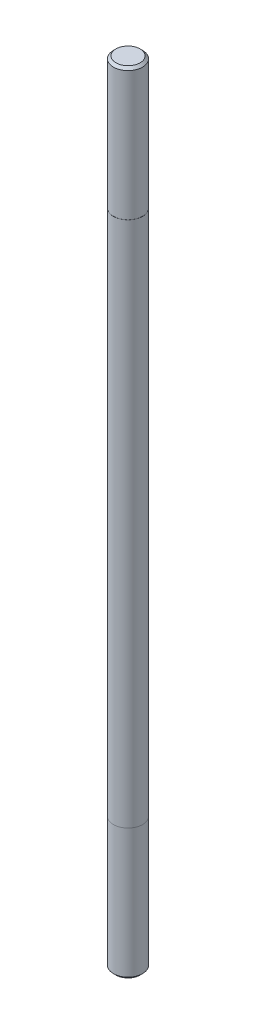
ISO-10303-21;
HEADER;
FILE_DESCRIPTION(('STEP AP214'),'2;1');
FILE_NAME('part.step','',(''),(''),'','','');
FILE_SCHEMA(('AUTOMOTIVE_DESIGN { 1 0 10303 214 1 1 1 1 }'));
ENDSEC;
DATA;
#1=APPLICATION_CONTEXT('core data for automotive mechanical design processes');
#2=APPLICATION_PROTOCOL_DEFINITION('international standard','automotive_design',2000,#1);
#3=PRODUCT_CONTEXT('',#1,'mechanical');
#4=PRODUCT('Part','Part','',(#3));
#5=PRODUCT_RELATED_PRODUCT_CATEGORY('part','',(#4));
#6=PRODUCT_DEFINITION_FORMATION('','',#4);
#7=PRODUCT_DEFINITION_CONTEXT('part definition',#1,'design');
#8=PRODUCT_DEFINITION('design','',#6,#7);
#9=PRODUCT_DEFINITION_SHAPE('','',#8);
#10=(LENGTH_UNIT() NAMED_UNIT(*) SI_UNIT(.MILLI.,.METRE.));
#11=(NAMED_UNIT(*) PLANE_ANGLE_UNIT() SI_UNIT($,.RADIAN.));
#12=(NAMED_UNIT(*) SI_UNIT($,.STERADIAN.) SOLID_ANGLE_UNIT());
#13=UNCERTAINTY_MEASURE_WITH_UNIT(LENGTH_MEASURE(1.E-05),#10,'distance_accuracy_value','');
#14=(GEOMETRIC_REPRESENTATION_CONTEXT(3) GLOBAL_UNCERTAINTY_ASSIGNED_CONTEXT((#13)) GLOBAL_UNIT_ASSIGNED_CONTEXT((#10,
#11,#12)) REPRESENTATION_CONTEXT('',''));
#15=CARTESIAN_POINT('',(0.,0.,0.));
#16=DIRECTION('',(0.,0.,1.));
#17=DIRECTION('',(1.,0.,0.));
#18=AXIS2_PLACEMENT_3D('',#15,#16,#17);
#19=CARTESIAN_POINT('',(0.,108.,0.));
#20=DIRECTION('',(0.,-1.,0.));
#21=DIRECTION('',(0.,0.,-1.));
#22=AXIS2_PLACEMENT_3D('',#19,#20,#21);
#23=CYLINDRICAL_SURFACE('',#22,2.);
#24=CARTESIAN_POINT('',(0.,90.,0.));
#25=DIRECTION('',(0.,1.,0.));
#26=DIRECTION('',(0.,0.,1.));
#27=AXIS2_PLACEMENT_3D('',#24,#25,#26);
#28=CIRCLE('',#27,2.);
#29=CARTESIAN_POINT('',(0.,90.,2.));
#30=VERTEX_POINT('',#29);
#31=EDGE_CURVE('E42',#30,#30,#28,.T.);
#32=ORIENTED_EDGE('',*,*,#31,.F.);
#33=EDGE_LOOP('',(#32));
#34=FACE_BOUND('',#33,.T.);
#35=CARTESIAN_POINT('',(0.,18.,0.));
#36=DIRECTION('',(0.,-1.,0.));
#37=DIRECTION('',(0.,0.,-1.));
#38=AXIS2_PLACEMENT_3D('',#35,#36,#37);
#39=CIRCLE('',#38,2.);
#40=CARTESIAN_POINT('',(0.,18.,-2.));
#41=VERTEX_POINT('',#40);
#42=EDGE_CURVE('E33',#41,#41,#39,.T.);
#43=ORIENTED_EDGE('',*,*,#42,.F.);
#44=EDGE_LOOP('',(#43));
#45=FACE_BOUND('',#44,.T.);
#46=ADVANCED_FACE('F30',(#34,#45),#23,.T.);
#47=CARTESIAN_POINT('',(0.,90.,0.));
#48=DIRECTION('',(0.,1.,0.));
#49=DIRECTION('',(0.,0.,1.));
#50=AXIS2_PLACEMENT_3D('',#47,#48,#49);
#51=PLANE('',#50);
#52=CARTESIAN_POINT('',(0.,90.,0.));
#53=DIRECTION('',(0.,1.,0.));
#54=DIRECTION('',(0.,0.,1.));
#55=AXIS2_PLACEMENT_3D('',#52,#53,#54);
#56=CIRCLE('',#55,1.99);
#57=CARTESIAN_POINT('',(0.,90.,1.99));
#58=VERTEX_POINT('',#57);
#59=EDGE_CURVE('E49',#58,#58,#56,.T.);
#60=ORIENTED_EDGE('',*,*,#59,.F.);
#61=EDGE_LOOP('',(#60));
#62=FACE_BOUND('',#61,.T.);
#63=ORIENTED_EDGE('',*,*,#31,.T.);
#64=EDGE_LOOP('',(#63));
#65=FACE_BOUND('',#64,.T.);
#66=ADVANCED_FACE('F66',(#62,#65),#51,.T.);
#67=CARTESIAN_POINT('',(0.,90.,0.));
#68=DIRECTION('',(0.,1.,0.));
#69=DIRECTION('',(0.,0.,1.));
#70=AXIS2_PLACEMENT_3D('',#67,#68,#69);
#71=CYLINDRICAL_SURFACE('',#70,1.99);
#72=CARTESIAN_POINT('',(0.,107.66,0.));
#73=DIRECTION('',(0.,-1.,0.));
#74=DIRECTION('',(0.,0.,-1.));
#75=AXIS2_PLACEMENT_3D('',#72,#73,#74);
#76=CIRCLE('',#75,1.99);
#77=CARTESIAN_POINT('',(0.,107.66,-1.99));
#78=VERTEX_POINT('',#77);
#79=EDGE_CURVE('E46',#78,#78,#76,.F.);
#80=ORIENTED_EDGE('',*,*,#79,.F.);
#81=EDGE_LOOP('',(#80));
#82=FACE_BOUND('',#81,.T.);
#83=ORIENTED_EDGE('',*,*,#59,.T.);
#84=EDGE_LOOP('',(#83));
#85=FACE_BOUND('',#84,.T.);
#86=ADVANCED_FACE('F64',(#82,#85),#71,.T.);
#87=CARTESIAN_POINT('',(0.,108.,0.));
#88=DIRECTION('',(0.,1.,0.));
#89=DIRECTION('',(0.,0.,1.));
#90=AXIS2_PLACEMENT_3D('',#87,#88,#89);
#91=PLANE('',#90);
#92=CARTESIAN_POINT('',(0.,108.,0.));
#93=DIRECTION('',(0.,1.,0.));
#94=DIRECTION('',(0.,0.,1.));
#95=AXIS2_PLACEMENT_3D('',#92,#93,#94);
#96=CIRCLE('',#95,1.65);
#97=CARTESIAN_POINT('',(0.,108.,1.65));
#98=VERTEX_POINT('',#97);
#99=EDGE_CURVE('E10',#98,#98,#96,.T.);
#100=ORIENTED_EDGE('',*,*,#99,.T.);
#101=EDGE_LOOP('',(#100));
#102=FACE_BOUND('',#101,.T.);
#103=ADVANCED_FACE('F89',(#102),#91,.T.);
#104=CARTESIAN_POINT('',(0.,108.,0.));
#105=DIRECTION('',(0.,-1.,0.));
#106=DIRECTION('',(0.,0.,-1.));
#107=AXIS2_PLACEMENT_3D('',#104,#105,#106);
#108=CONICAL_SURFACE('',#107,1.65,0.785398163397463);
#109=ORIENTED_EDGE('',*,*,#99,.F.);
#110=EDGE_LOOP('',(#109));
#111=FACE_BOUND('',#110,.T.);
#112=ORIENTED_EDGE('',*,*,#79,.T.);
#113=EDGE_LOOP('',(#112));
#114=FACE_BOUND('',#113,.T.);
#115=ADVANCED_FACE('F79',(#111,#114),#108,.T.);
#116=CARTESIAN_POINT('',(0.,18.,0.));
#117=DIRECTION('',(0.,-1.,0.));
#118=DIRECTION('',(0.,0.,-1.));
#119=AXIS2_PLACEMENT_3D('',#116,#117,#118);
#120=PLANE('',#119);
#121=CARTESIAN_POINT('',(0.,18.,0.));
#122=DIRECTION('',(0.,-1.,0.));
#123=DIRECTION('',(0.,0.,-1.));
#124=AXIS2_PLACEMENT_3D('',#121,#122,#123);
#125=CIRCLE('',#124,1.99);
#126=CARTESIAN_POINT('',(0.,18.,-1.99));
#127=VERTEX_POINT('',#126);
#128=EDGE_CURVE('E53',#127,#127,#125,.T.);
#129=ORIENTED_EDGE('',*,*,#128,.F.);
#130=EDGE_LOOP('',(#129));
#131=FACE_BOUND('',#130,.T.);
#132=ORIENTED_EDGE('',*,*,#42,.T.);
#133=EDGE_LOOP('',(#132));
#134=FACE_BOUND('',#133,.T.);
#135=ADVANCED_FACE('F76',(#131,#134),#120,.T.);
#136=CARTESIAN_POINT('',(0.,18.,0.));
#137=DIRECTION('',(0.,-1.,0.));
#138=DIRECTION('',(0.,0.,-1.));
#139=AXIS2_PLACEMENT_3D('',#136,#137,#138);
#140=CYLINDRICAL_SURFACE('',#139,1.99);
#141=CARTESIAN_POINT('',(0.,0.340000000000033,0.));
#142=DIRECTION('',(0.,1.,0.));
#143=DIRECTION('',(0.,0.,1.));
#144=AXIS2_PLACEMENT_3D('',#141,#142,#143);
#145=CIRCLE('',#144,1.99);
#146=CARTESIAN_POINT('',(0.,0.340000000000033,1.99));
#147=VERTEX_POINT('',#146);
#148=EDGE_CURVE('E51',#147,#147,#145,.F.);
#149=ORIENTED_EDGE('',*,*,#148,.F.);
#150=EDGE_LOOP('',(#149));
#151=FACE_BOUND('',#150,.T.);
#152=ORIENTED_EDGE('',*,*,#128,.T.);
#153=EDGE_LOOP('',(#152));
#154=FACE_BOUND('',#153,.T.);
#155=ADVANCED_FACE('F78',(#151,#154),#140,.T.);
#156=CARTESIAN_POINT('',(0.,0.,0.));
#157=DIRECTION('',(0.,1.,0.));
#158=DIRECTION('',(0.,0.,1.));
#159=AXIS2_PLACEMENT_3D('',#156,#157,#158);
#160=PLANE('',#159);
#161=CARTESIAN_POINT('',(0.,0.,0.));
#162=DIRECTION('',(0.,1.,0.));
#163=DIRECTION('',(0.,0.,1.));
#164=AXIS2_PLACEMENT_3D('',#161,#162,#163);
#165=CIRCLE('',#164,1.64999999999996);
#166=CARTESIAN_POINT('',(0.,0.,1.64999999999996));
#167=VERTEX_POINT('',#166);
#168=EDGE_CURVE('E37',#167,#167,#165,.F.);
#169=ORIENTED_EDGE('',*,*,#168,.T.);
#170=EDGE_LOOP('',(#169));
#171=FACE_BOUND('',#170,.T.);
#172=ADVANCED_FACE('F86',(#171),#160,.F.);
#173=CARTESIAN_POINT('',(0.,0.350000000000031,0.));
#174=DIRECTION('',(0.,1.,0.));
#175=DIRECTION('',(0.,0.,1.));
#176=AXIS2_PLACEMENT_3D('',#173,#174,#175);
#177=CONICAL_SURFACE('',#176,2.,0.785398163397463);
#178=ORIENTED_EDGE('',*,*,#168,.F.);
#179=EDGE_LOOP('',(#178));
#180=FACE_BOUND('',#179,.T.);
#181=ORIENTED_EDGE('',*,*,#148,.T.);
#182=EDGE_LOOP('',(#181));
#183=FACE_BOUND('',#182,.T.);
#184=ADVANCED_FACE('F96',(#180,#183),#177,.T.);
#185=CLOSED_SHELL('',(#46,#66,#86,#103,#115,#135,#155,#172,#184));
#186=MANIFOLD_SOLID_BREP('B2',#185);
#187=ADVANCED_BREP_SHAPE_REPRESENTATION('',(#18,#186),#14);
#188=SHAPE_DEFINITION_REPRESENTATION(#9,#187);
ENDSEC;
END-ISO-10303-21;
